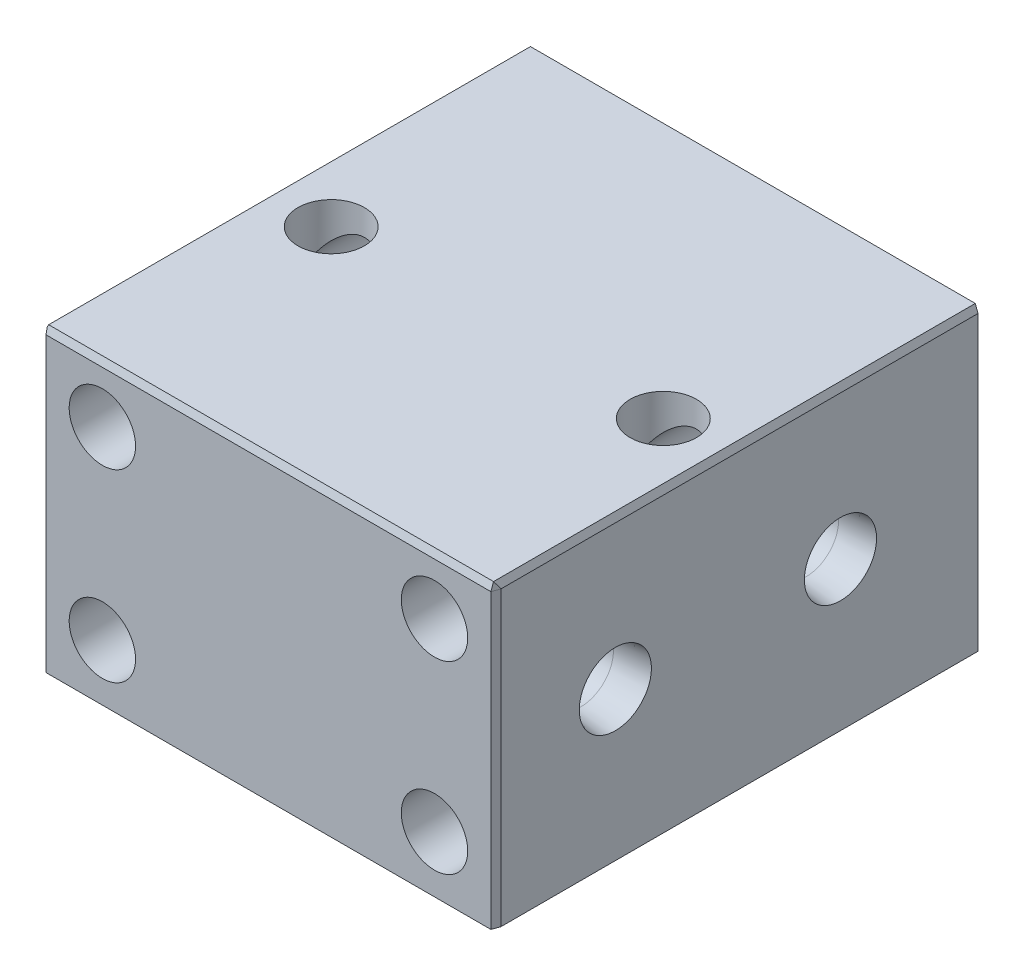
ISO-10303-21;
HEADER;
FILE_DESCRIPTION(('STEP AP214'),'2;1');
FILE_NAME('part.step','',(''),(''),'','','');
FILE_SCHEMA(('AUTOMOTIVE_DESIGN { 1 0 10303 214 1 1 1 1 }'));
ENDSEC;
DATA;
#1=APPLICATION_CONTEXT('core data for automotive mechanical design processes');
#2=APPLICATION_PROTOCOL_DEFINITION('international standard','automotive_design',2000,#1);
#3=PRODUCT_CONTEXT('',#1,'mechanical');
#4=PRODUCT('Part','Part','',(#3));
#5=PRODUCT_RELATED_PRODUCT_CATEGORY('part','',(#4));
#6=PRODUCT_DEFINITION_FORMATION('','',#4);
#7=PRODUCT_DEFINITION_CONTEXT('part definition',#1,'design');
#8=PRODUCT_DEFINITION('design','',#6,#7);
#9=PRODUCT_DEFINITION_SHAPE('','',#8);
#10=(LENGTH_UNIT() NAMED_UNIT(*) SI_UNIT(.MILLI.,.METRE.));
#11=(NAMED_UNIT(*) PLANE_ANGLE_UNIT() SI_UNIT($,.RADIAN.));
#12=(NAMED_UNIT(*) SI_UNIT($,.STERADIAN.) SOLID_ANGLE_UNIT());
#13=UNCERTAINTY_MEASURE_WITH_UNIT(LENGTH_MEASURE(1.E-05),#10,'distance_accuracy_value','');
#14=(GEOMETRIC_REPRESENTATION_CONTEXT(3) GLOBAL_UNCERTAINTY_ASSIGNED_CONTEXT((#13)) GLOBAL_UNIT_ASSIGNED_CONTEXT((#10,
#11,#12)) REPRESENTATION_CONTEXT('',''));
#15=CARTESIAN_POINT('',(0.,0.,0.));
#16=DIRECTION('',(0.,0.,1.));
#17=DIRECTION('',(1.,0.,0.));
#18=AXIS2_PLACEMENT_3D('',#15,#16,#17);
#19=CARTESIAN_POINT('',(22.5,12.5,66.));
#20=DIRECTION('',(0.,0.,-1.));
#21=DIRECTION('',(-1.,0.,0.));
#22=AXIS2_PLACEMENT_3D('',#19,#20,#21);
#23=CYLINDRICAL_SURFACE('',#22,4.5);
#24=CARTESIAN_POINT('',(22.5,12.5,0.));
#25=DIRECTION('',(0.,0.,-1.));
#26=DIRECTION('',(-1.,0.,0.));
#27=AXIS2_PLACEMENT_3D('',#24,#25,#26);
#28=CIRCLE('',#27,4.5);
#29=CARTESIAN_POINT('',(18.,12.5,0.));
#30=VERTEX_POINT('',#29);
#31=EDGE_CURVE('E232',#30,#30,#28,.T.);
#32=ORIENTED_EDGE('',*,*,#31,.T.);
#33=EDGE_LOOP('',(#32));
#34=FACE_BOUND('',#33,.T.);
#35=CARTESIAN_POINT('',(22.5,12.5,35.));
#36=DIRECTION('',(0.,-0.707106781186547,-0.707106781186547));
#37=DIRECTION('',(0.,0.707106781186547,-0.707106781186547));
#38=AXIS2_PLACEMENT_3D('',#35,#36,#37);
#39=ELLIPSE('',#38,6.36396103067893,4.5);
#40=CARTESIAN_POINT('',(27.,12.5,35.));
#41=VERTEX_POINT('',#40);
#42=CARTESIAN_POINT('',(18.,12.5,35.));
#43=VERTEX_POINT('',#42);
#44=EDGE_CURVE('E192',#41,#43,#39,.F.);
#45=ORIENTED_EDGE('',*,*,#44,.T.);
#46=CARTESIAN_POINT('',(22.5,12.5,35.));
#47=DIRECTION('',(0.,0.707106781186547,-0.707106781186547));
#48=DIRECTION('',(0.,-0.707106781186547,-0.707106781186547));
#49=AXIS2_PLACEMENT_3D('',#46,#47,#48);
#50=ELLIPSE('',#49,6.36396103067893,4.5);
#51=EDGE_CURVE('E208',#43,#41,#50,.F.);
#52=ORIENTED_EDGE('',*,*,#51,.T.);
#53=EDGE_LOOP('',(#45,#52));
#54=FACE_BOUND('',#53,.T.);
#55=ADVANCED_FACE('F33',(#34,#54),#23,.F.);
#56=CARTESIAN_POINT('',(-22.5,-12.5,66.));
#57=DIRECTION('',(0.,0.,-1.));
#58=DIRECTION('',(-1.,0.,0.));
#59=AXIS2_PLACEMENT_3D('',#56,#57,#58);
#60=CYLINDRICAL_SURFACE('',#59,4.5);
#61=CARTESIAN_POINT('',(-22.5,-12.5,0.));
#62=DIRECTION('',(0.,0.,-1.));
#63=DIRECTION('',(-1.,0.,0.));
#64=AXIS2_PLACEMENT_3D('',#61,#62,#63);
#65=CIRCLE('',#64,4.5);
#66=CARTESIAN_POINT('',(-27.,-12.5,0.));
#67=VERTEX_POINT('',#66);
#68=EDGE_CURVE('E222',#67,#67,#65,.T.);
#69=ORIENTED_EDGE('',*,*,#68,.T.);
#70=EDGE_LOOP('',(#69));
#71=FACE_BOUND('',#70,.T.);
#72=CARTESIAN_POINT('',(-22.5,-12.5,35.));
#73=DIRECTION('',(0.,-0.707106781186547,-0.707106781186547));
#74=DIRECTION('',(0.,0.707106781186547,-0.707106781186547));
#75=AXIS2_PLACEMENT_3D('',#72,#73,#74);
#76=ELLIPSE('',#75,6.36396103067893,4.5);
#77=CARTESIAN_POINT('',(-18.,-12.5,35.));
#78=VERTEX_POINT('',#77);
#79=CARTESIAN_POINT('',(-27.,-12.5,35.));
#80=VERTEX_POINT('',#79);
#81=EDGE_CURVE('E211',#78,#80,#76,.F.);
#82=ORIENTED_EDGE('',*,*,#81,.T.);
#83=CARTESIAN_POINT('',(-22.5,-12.5,35.));
#84=DIRECTION('',(0.,0.707106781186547,-0.707106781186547));
#85=DIRECTION('',(0.,-0.707106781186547,-0.707106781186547));
#86=AXIS2_PLACEMENT_3D('',#83,#84,#85);
#87=ELLIPSE('',#86,6.36396103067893,4.5);
#88=EDGE_CURVE('E219',#80,#78,#87,.F.);
#89=ORIENTED_EDGE('',*,*,#88,.T.);
#90=EDGE_LOOP('',(#82,#89));
#91=FACE_BOUND('',#90,.T.);
#92=ADVANCED_FACE('F479',(#71,#91),#60,.F.);
#93=CARTESIAN_POINT('',(-22.5,12.5,66.));
#94=DIRECTION('',(0.,0.,-1.));
#95=DIRECTION('',(-1.,0.,0.));
#96=AXIS2_PLACEMENT_3D('',#93,#94,#95);
#97=CYLINDRICAL_SURFACE('',#96,4.5);
#98=CARTESIAN_POINT('',(-22.5,12.5,0.));
#99=DIRECTION('',(0.,0.,-1.));
#100=DIRECTION('',(-1.,0.,0.));
#101=AXIS2_PLACEMENT_3D('',#98,#99,#100);
#102=CIRCLE('',#101,4.5);
#103=CARTESIAN_POINT('',(-27.,12.5,0.));
#104=VERTEX_POINT('',#103);
#105=EDGE_CURVE('E226',#104,#104,#102,.T.);
#106=ORIENTED_EDGE('',*,*,#105,.T.);
#107=EDGE_LOOP('',(#106));
#108=FACE_BOUND('',#107,.T.);
#109=CARTESIAN_POINT('',(-22.5,12.5,35.));
#110=DIRECTION('',(0.,-0.707106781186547,-0.707106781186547));
#111=DIRECTION('',(0.,0.707106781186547,-0.707106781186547));
#112=AXIS2_PLACEMENT_3D('',#109,#110,#111);
#113=ELLIPSE('',#112,6.36396103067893,4.5);
#114=CARTESIAN_POINT('',(-18.,12.5,35.));
#115=VERTEX_POINT('',#114);
#116=CARTESIAN_POINT('',(-27.,12.5,35.));
#117=VERTEX_POINT('',#116);
#118=EDGE_CURVE('E263',#115,#117,#113,.F.);
#119=ORIENTED_EDGE('',*,*,#118,.T.);
#120=CARTESIAN_POINT('',(-22.5,12.5,35.));
#121=DIRECTION('',(0.,0.707106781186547,-0.707106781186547));
#122=DIRECTION('',(0.,-0.707106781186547,-0.707106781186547));
#123=AXIS2_PLACEMENT_3D('',#120,#121,#122);
#124=ELLIPSE('',#123,6.36396103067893,4.5);
#125=EDGE_CURVE('E271',#117,#115,#124,.F.);
#126=ORIENTED_EDGE('',*,*,#125,.T.);
#127=EDGE_LOOP('',(#119,#126));
#128=FACE_BOUND('',#127,.T.);
#129=ADVANCED_FACE('F486',(#108,#128),#97,.F.);
#130=CARTESIAN_POINT('',(22.5,-12.5,66.));
#131=DIRECTION('',(0.,0.,-1.));
#132=DIRECTION('',(-1.,0.,0.));
#133=AXIS2_PLACEMENT_3D('',#130,#131,#132);
#134=CYLINDRICAL_SURFACE('',#133,4.5);
#135=CARTESIAN_POINT('',(22.5,-12.5,0.));
#136=DIRECTION('',(0.,0.,-1.));
#137=DIRECTION('',(-1.,0.,0.));
#138=AXIS2_PLACEMENT_3D('',#135,#136,#137);
#139=CIRCLE('',#138,4.5);
#140=CARTESIAN_POINT('',(18.,-12.5,0.));
#141=VERTEX_POINT('',#140);
#142=EDGE_CURVE('E233',#141,#141,#139,.T.);
#143=ORIENTED_EDGE('',*,*,#142,.T.);
#144=EDGE_LOOP('',(#143));
#145=FACE_BOUND('',#144,.T.);
#146=CARTESIAN_POINT('',(22.5,-12.5,35.));
#147=DIRECTION('',(0.,-0.707106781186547,-0.707106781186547));
#148=DIRECTION('',(0.,0.707106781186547,-0.707106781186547));
#149=AXIS2_PLACEMENT_3D('',#146,#147,#148);
#150=ELLIPSE('',#149,6.36396103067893,4.5);
#151=CARTESIAN_POINT('',(27.,-12.5,35.));
#152=VERTEX_POINT('',#151);
#153=CARTESIAN_POINT('',(18.,-12.5,35.));
#154=VERTEX_POINT('',#153);
#155=EDGE_CURVE('E250',#152,#154,#150,.F.);
#156=ORIENTED_EDGE('',*,*,#155,.T.);
#157=CARTESIAN_POINT('',(22.5,-12.5,35.));
#158=DIRECTION('',(0.,0.707106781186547,-0.707106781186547));
#159=DIRECTION('',(0.,-0.707106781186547,-0.707106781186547));
#160=AXIS2_PLACEMENT_3D('',#157,#158,#159);
#161=ELLIPSE('',#160,6.36396103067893,4.5);
#162=EDGE_CURVE('E260',#154,#152,#161,.F.);
#163=ORIENTED_EDGE('',*,*,#162,.T.);
#164=EDGE_LOOP('',(#156,#163));
#165=FACE_BOUND('',#164,.T.);
#166=ADVANCED_FACE('F526',(#145,#165),#134,.F.);
#167=CARTESIAN_POINT('',(30.5,20.5,66.));
#168=DIRECTION('',(-1.,0.,0.));
#169=DIRECTION('',(0.,0.,1.));
#170=AXIS2_PLACEMENT_3D('',#167,#168,#169);
#171=PLANE('',#170);
#172=DIRECTION('',(0.,0.,1.));
#173=VECTOR('',#172,1.);
#174=CARTESIAN_POINT('',(30.5,19.5,66.));
#175=LINE('',#174,#173);
#176=CARTESIAN_POINT('',(30.5,19.5,0.363970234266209));
#177=VERTEX_POINT('',#176);
#178=CARTESIAN_POINT('',(30.5,19.5,65.));
#179=VERTEX_POINT('',#178);
#180=EDGE_CURVE('E302',#177,#179,#175,.T.);
#181=ORIENTED_EDGE('',*,*,#180,.T.);
#182=DIRECTION('',(0.,-1.,0.));
#183=VECTOR('',#182,1.);
#184=CARTESIAN_POINT('',(30.5,-20.5,65.));
#185=LINE('',#184,#183);
#186=CARTESIAN_POINT('',(30.5,-20.1360297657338,65.));
#187=VERTEX_POINT('',#186);
#188=EDGE_CURVE('E308',#179,#187,#185,.T.);
#189=ORIENTED_EDGE('',*,*,#188,.T.);
#190=DIRECTION('',(0.,0.,-1.));
#191=VECTOR('',#190,1.);
#192=CARTESIAN_POINT('',(30.5,-20.1360297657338,66.));
#193=LINE('',#192,#191);
#194=CARTESIAN_POINT('',(30.5,-20.1360297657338,0.363970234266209));
#195=VERTEX_POINT('',#194);
#196=EDGE_CURVE('E306',#187,#195,#193,.T.);
#197=ORIENTED_EDGE('',*,*,#196,.T.);
#198=DIRECTION('',(0.,1.,0.));
#199=VECTOR('',#198,1.);
#200=CARTESIAN_POINT('',(30.5,20.5,0.363970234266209));
#201=LINE('',#200,#199);
#202=EDGE_CURVE('E304',#195,#177,#201,.T.);
#203=ORIENTED_EDGE('',*,*,#202,.T.);
#204=EDGE_LOOP('',(#181,#189,#197,#203));
#205=FACE_BOUND('',#204,.T.);
#206=CARTESIAN_POINT('',(30.5,0.,19.));
#207=DIRECTION('',(1.,0.,0.));
#208=DIRECTION('',(0.,0.,-1.));
#209=AXIS2_PLACEMENT_3D('',#206,#207,#208);
#210=CIRCLE('',#209,4.889);
#211=CARTESIAN_POINT('',(30.5,0.,14.111));
#212=VERTEX_POINT('',#211);
#213=EDGE_CURVE('E179',#212,#212,#210,.T.);
#214=ORIENTED_EDGE('',*,*,#213,.F.);
#215=EDGE_LOOP('',(#214));
#216=FACE_BOUND('',#215,.T.);
#217=CARTESIAN_POINT('',(30.5,0.,49.5));
#218=DIRECTION('',(1.,0.,0.));
#219=DIRECTION('',(0.,0.,-1.));
#220=AXIS2_PLACEMENT_3D('',#217,#218,#219);
#221=CIRCLE('',#220,4.889);
#222=CARTESIAN_POINT('',(30.5,0.,44.611));
#223=VERTEX_POINT('',#222);
#224=EDGE_CURVE('E172',#223,#223,#221,.T.);
#225=ORIENTED_EDGE('',*,*,#224,.F.);
#226=EDGE_LOOP('',(#225));
#227=FACE_BOUND('',#226,.T.);
#228=ADVANCED_FACE('F426',(#205,#216,#227),#171,.F.);
#229=CARTESIAN_POINT('',(-30.5,20.5,66.));
#230=DIRECTION('',(0.,-1.,0.));
#231=DIRECTION('',(0.,0.,-1.));
#232=AXIS2_PLACEMENT_3D('',#229,#230,#231);
#233=PLANE('',#232);
#234=DIRECTION('',(-1.,0.,0.));
#235=VECTOR('',#234,1.);
#236=CARTESIAN_POINT('',(-30.5,20.5,0.363970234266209));
#237=LINE('',#236,#235);
#238=CARTESIAN_POINT('',(30.1360297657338,20.5,0.363970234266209));
#239=VERTEX_POINT('',#238);
#240=CARTESIAN_POINT('',(-30.1360297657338,20.5,0.363970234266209));
#241=VERTEX_POINT('',#240);
#242=EDGE_CURVE('E311',#239,#241,#237,.T.);
#243=ORIENTED_EDGE('',*,*,#242,.T.);
#244=DIRECTION('',(0.,0.,1.));
#245=VECTOR('',#244,1.);
#246=CARTESIAN_POINT('',(-30.1360297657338,20.5,66.));
#247=LINE('',#246,#245);
#248=CARTESIAN_POINT('',(-30.1360297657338,20.5,65.6360297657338));
#249=VERTEX_POINT('',#248);
#250=EDGE_CURVE('E318',#241,#249,#247,.T.);
#251=ORIENTED_EDGE('',*,*,#250,.T.);
#252=DIRECTION('',(1.,0.,0.));
#253=VECTOR('',#252,1.);
#254=CARTESIAN_POINT('',(30.5,20.5,65.6360297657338));
#255=LINE('',#254,#253);
#256=CARTESIAN_POINT('',(30.1360297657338,20.5,65.6360297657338));
#257=VERTEX_POINT('',#256);
#258=EDGE_CURVE('E316',#249,#257,#255,.T.);
#259=ORIENTED_EDGE('',*,*,#258,.T.);
#260=DIRECTION('',(0.,0.,-1.));
#261=VECTOR('',#260,1.);
#262=CARTESIAN_POINT('',(30.1360297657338,20.5,66.));
#263=LINE('',#262,#261);
#264=EDGE_CURVE('E314',#257,#239,#263,.T.);
#265=ORIENTED_EDGE('',*,*,#264,.T.);
#266=EDGE_LOOP('',(#243,#251,#259,#265));
#267=FACE_BOUND('',#266,.T.);
#268=CARTESIAN_POINT('',(-22.5,20.5,35.));
#269=DIRECTION('',(0.,1.,0.));
#270=DIRECTION('',(0.,0.,1.));
#271=AXIS2_PLACEMENT_3D('',#268,#269,#270);
#272=CIRCLE('',#271,4.5);
#273=CARTESIAN_POINT('',(-22.5,20.5,39.5));
#274=VERTEX_POINT('',#273);
#275=EDGE_CURVE('E193',#274,#274,#272,.T.);
#276=ORIENTED_EDGE('',*,*,#275,.F.);
#277=EDGE_LOOP('',(#276));
#278=FACE_BOUND('',#277,.T.);
#279=CARTESIAN_POINT('',(22.5,20.5,35.));
#280=DIRECTION('',(0.,1.,0.));
#281=DIRECTION('',(0.,0.,1.));
#282=AXIS2_PLACEMENT_3D('',#279,#280,#281);
#283=CIRCLE('',#282,4.5);
#284=CARTESIAN_POINT('',(22.5,20.5,39.5));
#285=VERTEX_POINT('',#284);
#286=EDGE_CURVE('E188',#285,#285,#283,.T.);
#287=ORIENTED_EDGE('',*,*,#286,.F.);
#288=EDGE_LOOP('',(#287));
#289=FACE_BOUND('',#288,.T.);
#290=ADVANCED_FACE('F440',(#267,#278,#289),#233,.F.);
#291=CARTESIAN_POINT('',(-30.5,20.5,66.));
#292=DIRECTION('',(1.,0.,0.));
#293=DIRECTION('',(0.,1.,0.));
#294=AXIS2_PLACEMENT_3D('',#291,#292,#293);
#295=PLANE('',#294);
#296=DIRECTION('',(0.,0.,1.));
#297=VECTOR('',#296,1.);
#298=CARTESIAN_POINT('',(-30.5,-19.5,66.));
#299=LINE('',#298,#297);
#300=CARTESIAN_POINT('',(-30.5,-19.5,0.363970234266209));
#301=VERTEX_POINT('',#300);
#302=CARTESIAN_POINT('',(-30.5,-19.5,65.));
#303=VERTEX_POINT('',#302);
#304=EDGE_CURVE('E292',#301,#303,#299,.T.);
#305=ORIENTED_EDGE('',*,*,#304,.T.);
#306=DIRECTION('',(0.,1.,0.));
#307=VECTOR('',#306,1.);
#308=CARTESIAN_POINT('',(-30.5,19.5,65.));
#309=LINE('',#308,#307);
#310=CARTESIAN_POINT('',(-30.5,19.5,65.));
#311=VERTEX_POINT('',#310);
#312=EDGE_CURVE('E378',#303,#311,#309,.T.);
#313=ORIENTED_EDGE('',*,*,#312,.T.);
#314=DIRECTION('',(0.,0.,-1.));
#315=VECTOR('',#314,1.);
#316=CARTESIAN_POINT('',(-30.5,19.5,66.));
#317=LINE('',#316,#315);
#318=CARTESIAN_POINT('',(-30.5,19.5,0.363970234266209));
#319=VERTEX_POINT('',#318);
#320=EDGE_CURVE('E289',#311,#319,#317,.T.);
#321=ORIENTED_EDGE('',*,*,#320,.T.);
#322=DIRECTION('',(0.,-1.,0.));
#323=VECTOR('',#322,1.);
#324=CARTESIAN_POINT('',(-30.5,20.5,0.363970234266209));
#325=LINE('',#324,#323);
#326=EDGE_CURVE('E375',#319,#301,#325,.T.);
#327=ORIENTED_EDGE('',*,*,#326,.T.);
#328=EDGE_LOOP('',(#305,#313,#321,#327));
#329=FACE_BOUND('',#328,.T.);
#330=ADVANCED_FACE('F449',(#329),#295,.F.);
#331=CARTESIAN_POINT('',(-30.5,-20.5,66.));
#332=DIRECTION('',(0.,1.,0.));
#333=DIRECTION('',(0.,0.,1.));
#334=AXIS2_PLACEMENT_3D('',#331,#332,#333);
#335=PLANE('',#334);
#336=DIRECTION('',(0.,0.,-1.));
#337=VECTOR('',#336,1.);
#338=CARTESIAN_POINT('',(-30.1360297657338,-20.5,66.));
#339=LINE('',#338,#337);
#340=CARTESIAN_POINT('',(-30.1360297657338,-20.5,65.));
#341=VERTEX_POINT('',#340);
#342=CARTESIAN_POINT('',(-30.1360297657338,-20.5,0.363970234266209));
#343=VERTEX_POINT('',#342);
#344=EDGE_CURVE('E278',#341,#343,#339,.T.);
#345=ORIENTED_EDGE('',*,*,#344,.T.);
#346=DIRECTION('',(1.,0.,0.));
#347=VECTOR('',#346,1.);
#348=CARTESIAN_POINT('',(-30.5,-20.5,0.363970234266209));
#349=LINE('',#348,#347);
#350=CARTESIAN_POINT('',(29.5,-20.5,0.363970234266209));
#351=VERTEX_POINT('',#350);
#352=EDGE_CURVE('E280',#343,#351,#349,.T.);
#353=ORIENTED_EDGE('',*,*,#352,.T.);
#354=DIRECTION('',(0.,0.,1.));
#355=VECTOR('',#354,1.);
#356=CARTESIAN_POINT('',(29.5,-20.5,66.));
#357=LINE('',#356,#355);
#358=CARTESIAN_POINT('',(29.5,-20.5,65.));
#359=VERTEX_POINT('',#358);
#360=EDGE_CURVE('E274',#351,#359,#357,.T.);
#361=ORIENTED_EDGE('',*,*,#360,.T.);
#362=DIRECTION('',(-1.,0.,0.));
#363=VECTOR('',#362,1.);
#364=CARTESIAN_POINT('',(-30.5,-20.5,65.));
#365=LINE('',#364,#363);
#366=EDGE_CURVE('E276',#359,#341,#365,.T.);
#367=ORIENTED_EDGE('',*,*,#366,.T.);
#368=EDGE_LOOP('',(#345,#353,#361,#367));
#369=FACE_BOUND('',#368,.T.);
#370=CARTESIAN_POINT('',(0.,-20.5,49.5));
#371=DIRECTION('',(0.,-1.,0.));
#372=DIRECTION('',(0.,0.,-1.));
#373=AXIS2_PLACEMENT_3D('',#370,#371,#372);
#374=CIRCLE('',#373,5.);
#375=CARTESIAN_POINT('',(0.,-20.5,44.5));
#376=VERTEX_POINT('',#375);
#377=EDGE_CURVE('E956',#376,#376,#374,.T.);
#378=ORIENTED_EDGE('',*,*,#377,.F.);
#379=EDGE_LOOP('',(#378));
#380=FACE_BOUND('',#379,.T.);
#381=CARTESIAN_POINT('',(0.,-20.5,19.));
#382=DIRECTION('',(0.,-1.,0.));
#383=DIRECTION('',(0.,0.,-1.));
#384=AXIS2_PLACEMENT_3D('',#381,#382,#383);
#385=CIRCLE('',#384,5.);
#386=CARTESIAN_POINT('',(0.,-20.5,14.));
#387=VERTEX_POINT('',#386);
#388=EDGE_CURVE('E366',#387,#387,#385,.T.);
#389=ORIENTED_EDGE('',*,*,#388,.F.);
#390=EDGE_LOOP('',(#389));
#391=FACE_BOUND('',#390,.T.);
#392=CARTESIAN_POINT('',(-22.5,-20.5,35.));
#393=DIRECTION('',(0.,1.,0.));
#394=DIRECTION('',(0.,0.,1.));
#395=AXIS2_PLACEMENT_3D('',#392,#393,#394);
#396=CIRCLE('',#395,4.5);
#397=CARTESIAN_POINT('',(-22.5,-20.5,39.5));
#398=VERTEX_POINT('',#397);
#399=EDGE_CURVE('E189',#398,#398,#396,.T.);
#400=ORIENTED_EDGE('',*,*,#399,.T.);
#401=EDGE_LOOP('',(#400));
#402=FACE_BOUND('',#401,.T.);
#403=CARTESIAN_POINT('',(22.5,-20.5,35.));
#404=DIRECTION('',(0.,1.,0.));
#405=DIRECTION('',(0.,0.,1.));
#406=AXIS2_PLACEMENT_3D('',#403,#404,#405);
#407=CIRCLE('',#406,4.5);
#408=CARTESIAN_POINT('',(22.5,-20.5,39.5));
#409=VERTEX_POINT('',#408);
#410=EDGE_CURVE('E196',#409,#409,#407,.T.);
#411=ORIENTED_EDGE('',*,*,#410,.T.);
#412=EDGE_LOOP('',(#411));
#413=FACE_BOUND('',#412,.T.);
#414=ADVANCED_FACE('F414',(#369,#380,#391,#402,#413),#335,.F.);
#415=CARTESIAN_POINT('',(0.,0.,66.));
#416=DIRECTION('',(0.,0.,1.));
#417=DIRECTION('',(1.,0.,0.));
#418=AXIS2_PLACEMENT_3D('',#415,#416,#417);
#419=PLANE('',#418);
#420=CARTESIAN_POINT('',(22.5,-12.5,66.));
#421=DIRECTION('',(0.,0.,-1.));
#422=DIRECTION('',(-1.,0.,0.));
#423=AXIS2_PLACEMENT_3D('',#420,#421,#422);
#424=CIRCLE('',#423,4.5);
#425=CARTESIAN_POINT('',(18.,-12.5,66.));
#426=VERTEX_POINT('',#425);
#427=EDGE_CURVE('E229',#426,#426,#424,.T.);
#428=ORIENTED_EDGE('',*,*,#427,.T.);
#429=EDGE_LOOP('',(#428));
#430=FACE_BOUND('',#429,.T.);
#431=CARTESIAN_POINT('',(-22.5,12.5,66.));
#432=DIRECTION('',(0.,0.,-1.));
#433=DIRECTION('',(-1.,0.,0.));
#434=AXIS2_PLACEMENT_3D('',#431,#432,#433);
#435=CIRCLE('',#434,4.5);
#436=CARTESIAN_POINT('',(-27.,12.5,66.));
#437=VERTEX_POINT('',#436);
#438=EDGE_CURVE('E236',#437,#437,#435,.T.);
#439=ORIENTED_EDGE('',*,*,#438,.T.);
#440=EDGE_LOOP('',(#439));
#441=FACE_BOUND('',#440,.T.);
#442=CARTESIAN_POINT('',(-22.5,-12.5,66.));
#443=DIRECTION('',(0.,0.,-1.));
#444=DIRECTION('',(-1.,0.,0.));
#445=AXIS2_PLACEMENT_3D('',#442,#443,#444);
#446=CIRCLE('',#445,4.5);
#447=CARTESIAN_POINT('',(-27.,-12.5,66.));
#448=VERTEX_POINT('',#447);
#449=EDGE_CURVE('E223',#448,#448,#446,.T.);
#450=ORIENTED_EDGE('',*,*,#449,.T.);
#451=EDGE_LOOP('',(#450));
#452=FACE_BOUND('',#451,.T.);
#453=CARTESIAN_POINT('',(22.5,12.5,66.));
#454=DIRECTION('',(0.,0.,-1.));
#455=DIRECTION('',(-1.,0.,0.));
#456=AXIS2_PLACEMENT_3D('',#453,#454,#455);
#457=CIRCLE('',#456,4.5);
#458=CARTESIAN_POINT('',(18.,12.5,66.));
#459=VERTEX_POINT('',#458);
#460=EDGE_CURVE('E241',#459,#459,#457,.T.);
#461=ORIENTED_EDGE('',*,*,#460,.T.);
#462=EDGE_LOOP('',(#461));
#463=FACE_BOUND('',#462,.T.);
#464=DIRECTION('',(-1.,0.,0.));
#465=VECTOR('',#464,1.);
#466=CARTESIAN_POINT('',(-30.5,19.5,66.));
#467=LINE('',#466,#465);
#468=CARTESIAN_POINT('',(30.1360297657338,19.5,66.));
#469=VERTEX_POINT('',#468);
#470=CARTESIAN_POINT('',(-30.1360297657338,19.5,66.));
#471=VERTEX_POINT('',#470);
#472=EDGE_CURVE('E295',#469,#471,#467,.T.);
#473=ORIENTED_EDGE('',*,*,#472,.T.);
#474=DIRECTION('',(0.,-1.,0.));
#475=VECTOR('',#474,1.);
#476=CARTESIAN_POINT('',(-30.1360297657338,-19.5,66.));
#477=LINE('',#476,#475);
#478=CARTESIAN_POINT('',(-30.1360297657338,-20.1360297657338,66.));
#479=VERTEX_POINT('',#478);
#480=EDGE_CURVE('E321',#471,#479,#477,.T.);
#481=ORIENTED_EDGE('',*,*,#480,.T.);
#482=DIRECTION('',(1.,0.,0.));
#483=VECTOR('',#482,1.);
#484=CARTESIAN_POINT('',(30.5,-20.1360297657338,66.));
#485=LINE('',#484,#483);
#486=CARTESIAN_POINT('',(30.1360297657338,-20.1360297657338,66.));
#487=VERTEX_POINT('',#486);
#488=EDGE_CURVE('E300',#479,#487,#485,.T.);
#489=ORIENTED_EDGE('',*,*,#488,.T.);
#490=DIRECTION('',(0.,1.,0.));
#491=VECTOR('',#490,1.);
#492=CARTESIAN_POINT('',(30.1360297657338,20.5,66.));
#493=LINE('',#492,#491);
#494=EDGE_CURVE('E298',#487,#469,#493,.T.);
#495=ORIENTED_EDGE('',*,*,#494,.T.);
#496=EDGE_LOOP('',(#473,#481,#489,#495));
#497=FACE_BOUND('',#496,.T.);
#498=ADVANCED_FACE('F397',(#430,#441,#452,#463,#497),#419,.T.);
#499=CARTESIAN_POINT('',(0.,0.,0.));
#500=DIRECTION('',(0.,0.,1.));
#501=DIRECTION('',(1.,0.,0.));
#502=AXIS2_PLACEMENT_3D('',#499,#500,#501);
#503=PLANE('',#502);
#504=ORIENTED_EDGE('',*,*,#142,.F.);
#505=EDGE_LOOP('',(#504));
#506=FACE_BOUND('',#505,.T.);
#507=ORIENTED_EDGE('',*,*,#105,.F.);
#508=EDGE_LOOP('',(#507));
#509=FACE_BOUND('',#508,.T.);
#510=ORIENTED_EDGE('',*,*,#68,.F.);
#511=EDGE_LOOP('',(#510));
#512=FACE_BOUND('',#511,.T.);
#513=ORIENTED_EDGE('',*,*,#31,.F.);
#514=EDGE_LOOP('',(#513));
#515=FACE_BOUND('',#514,.T.);
#516=CARTESIAN_POINT('',(0.,0.,0.));
#517=DIRECTION('',(0.,0.,-1.));
#518=DIRECTION('',(-1.,0.,0.));
#519=AXIS2_PLACEMENT_3D('',#516,#517,#518);
#520=CIRCLE('',#519,6.);
#521=CARTESIAN_POINT('',(-6.,0.,0.));
#522=VERTEX_POINT('',#521);
#523=EDGE_CURVE('E244',#522,#522,#520,.T.);
#524=ORIENTED_EDGE('',*,*,#523,.F.);
#525=EDGE_LOOP('',(#524));
#526=FACE_BOUND('',#525,.T.);
#527=DIRECTION('',(-1.,0.,0.));
#528=VECTOR('',#527,1.);
#529=CARTESIAN_POINT('',(0.,-19.5,0.));
#530=LINE('',#529,#528);
#531=CARTESIAN_POINT('',(29.5,-19.5,0.));
#532=VERTEX_POINT('',#531);
#533=CARTESIAN_POINT('',(-29.5,-19.5,0.));
#534=VERTEX_POINT('',#533);
#535=EDGE_CURVE('E287',#532,#534,#530,.T.);
#536=ORIENTED_EDGE('',*,*,#535,.T.);
#537=DIRECTION('',(0.,1.,0.));
#538=VECTOR('',#537,1.);
#539=CARTESIAN_POINT('',(-29.5,0.,0.));
#540=LINE('',#539,#538);
#541=CARTESIAN_POINT('',(-29.5,19.5,0.));
#542=VERTEX_POINT('',#541);
#543=EDGE_CURVE('E41',#534,#542,#540,.T.);
#544=ORIENTED_EDGE('',*,*,#543,.T.);
#545=DIRECTION('',(1.,0.,0.));
#546=VECTOR('',#545,1.);
#547=CARTESIAN_POINT('',(0.,19.5,0.));
#548=LINE('',#547,#546);
#549=CARTESIAN_POINT('',(29.5,19.5,0.));
#550=VERTEX_POINT('',#549);
#551=EDGE_CURVE('E283',#542,#550,#548,.T.);
#552=ORIENTED_EDGE('',*,*,#551,.T.);
#553=DIRECTION('',(0.,-1.,0.));
#554=VECTOR('',#553,1.);
#555=CARTESIAN_POINT('',(29.5,0.,0.));
#556=LINE('',#555,#554);
#557=EDGE_CURVE('E285',#550,#532,#556,.T.);
#558=ORIENTED_EDGE('',*,*,#557,.T.);
#559=EDGE_LOOP('',(#536,#544,#552,#558));
#560=FACE_BOUND('',#559,.T.);
#561=ADVANCED_FACE('F458',(#506,#509,#512,#515,#526,#560),#503,.F.);
#562=CARTESIAN_POINT('',(0.,0.,50.));
#563=DIRECTION('',(0.,0.,-1.));
#564=DIRECTION('',(-1.,0.,0.));
#565=AXIS2_PLACEMENT_3D('',#562,#563,#564);
#566=CYLINDRICAL_SURFACE('',#565,6.);
#567=CARTESIAN_POINT('',(0.,0.,50.));
#568=DIRECTION('',(0.,0.,-1.));
#569=DIRECTION('',(-1.,0.,0.));
#570=AXIS2_PLACEMENT_3D('',#567,#568,#569);
#571=CIRCLE('',#570,6.);
#572=CARTESIAN_POINT('',(-6.,0.,50.));
#573=VERTEX_POINT('',#572);
#574=EDGE_CURVE('E247',#573,#573,#571,.T.);
#575=ORIENTED_EDGE('',*,*,#574,.F.);
#576=EDGE_LOOP('',(#575));
#577=FACE_BOUND('',#576,.T.);
#578=ORIENTED_EDGE('',*,*,#523,.T.);
#579=EDGE_LOOP('',(#578));
#580=FACE_BOUND('',#579,.T.);
#581=ADVANCED_FACE('F502',(#577,#580),#566,.F.);
#582=CARTESIAN_POINT('',(0.,0.,50.));
#583=DIRECTION('',(0.,0.,-1.));
#584=DIRECTION('',(-1.,0.,0.));
#585=AXIS2_PLACEMENT_3D('',#582,#583,#584);
#586=PLANE('',#585);
#587=ORIENTED_EDGE('',*,*,#574,.T.);
#588=EDGE_LOOP('',(#587));
#589=FACE_BOUND('',#588,.T.);
#590=ADVANCED_FACE('F494',(#589),#586,.T.);
#591=CARTESIAN_POINT('',(22.5,12.5,35.));
#592=DIRECTION('',(0.,-0.707106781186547,-0.707106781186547));
#593=DIRECTION('',(0.,0.707106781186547,-0.707106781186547));
#594=AXIS2_PLACEMENT_3D('',#591,#592,#593);
#595=ELLIPSE('',#594,6.36396103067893,4.5);
#596=EDGE_CURVE('E202',#41,#43,#595,.T.);
#597=ORIENTED_EDGE('',*,*,#596,.T.);
#598=CARTESIAN_POINT('',(22.5,12.5,35.));
#599=DIRECTION('',(0.,0.707106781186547,-0.707106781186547));
#600=DIRECTION('',(0.,-0.707106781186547,-0.707106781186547));
#601=AXIS2_PLACEMENT_3D('',#598,#599,#600);
#602=ELLIPSE('',#601,6.36396103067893,4.5);
#603=EDGE_CURVE('E205',#43,#41,#602,.T.);
#604=ORIENTED_EDGE('',*,*,#603,.T.);
#605=EDGE_LOOP('',(#597,#604));
#606=FACE_BOUND('',#605,.T.);
#607=ORIENTED_EDGE('',*,*,#460,.F.);
#608=EDGE_LOOP('',(#607));
#609=FACE_BOUND('',#608,.T.);
#610=ADVANCED_FACE('F482',(#606,#609),#23,.F.);
#611=CARTESIAN_POINT('',(-22.5,-12.5,35.));
#612=DIRECTION('',(0.,-0.707106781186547,-0.707106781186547));
#613=DIRECTION('',(0.,0.707106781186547,-0.707106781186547));
#614=AXIS2_PLACEMENT_3D('',#611,#612,#613);
#615=ELLIPSE('',#614,6.36396103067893,4.5);
#616=EDGE_CURVE('E213',#78,#80,#615,.T.);
#617=ORIENTED_EDGE('',*,*,#616,.T.);
#618=CARTESIAN_POINT('',(-22.5,-12.5,35.));
#619=DIRECTION('',(0.,0.707106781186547,-0.707106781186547));
#620=DIRECTION('',(0.,-0.707106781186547,-0.707106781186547));
#621=AXIS2_PLACEMENT_3D('',#618,#619,#620);
#622=ELLIPSE('',#621,6.36396103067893,4.5);
#623=EDGE_CURVE('E216',#80,#78,#622,.T.);
#624=ORIENTED_EDGE('',*,*,#623,.T.);
#625=EDGE_LOOP('',(#617,#624));
#626=FACE_BOUND('',#625,.T.);
#627=ORIENTED_EDGE('',*,*,#449,.F.);
#628=EDGE_LOOP('',(#627));
#629=FACE_BOUND('',#628,.T.);
#630=ADVANCED_FACE('F489',(#626,#629),#60,.F.);
#631=CARTESIAN_POINT('',(-22.5,12.5,35.));
#632=DIRECTION('',(0.,-0.707106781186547,-0.707106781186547));
#633=DIRECTION('',(0.,0.707106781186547,-0.707106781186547));
#634=AXIS2_PLACEMENT_3D('',#631,#632,#633);
#635=ELLIPSE('',#634,6.36396103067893,4.5);
#636=EDGE_CURVE('E265',#115,#117,#635,.T.);
#637=ORIENTED_EDGE('',*,*,#636,.T.);
#638=CARTESIAN_POINT('',(-22.5,12.5,35.));
#639=DIRECTION('',(0.,0.707106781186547,-0.707106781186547));
#640=DIRECTION('',(0.,-0.707106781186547,-0.707106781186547));
#641=AXIS2_PLACEMENT_3D('',#638,#639,#640);
#642=ELLIPSE('',#641,6.36396103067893,4.5);
#643=EDGE_CURVE('E268',#117,#115,#642,.T.);
#644=ORIENTED_EDGE('',*,*,#643,.T.);
#645=EDGE_LOOP('',(#637,#644));
#646=FACE_BOUND('',#645,.T.);
#647=ORIENTED_EDGE('',*,*,#438,.F.);
#648=EDGE_LOOP('',(#647));
#649=FACE_BOUND('',#648,.T.);
#650=ADVANCED_FACE('F500',(#646,#649),#97,.F.);
#651=CARTESIAN_POINT('',(22.5,-12.5,35.));
#652=DIRECTION('',(0.,-0.707106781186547,-0.707106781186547));
#653=DIRECTION('',(0.,0.707106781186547,-0.707106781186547));
#654=AXIS2_PLACEMENT_3D('',#651,#652,#653);
#655=ELLIPSE('',#654,6.36396103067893,4.5);
#656=EDGE_CURVE('E254',#152,#154,#655,.T.);
#657=ORIENTED_EDGE('',*,*,#656,.T.);
#658=CARTESIAN_POINT('',(22.5,-12.5,35.));
#659=DIRECTION('',(0.,0.707106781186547,-0.707106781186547));
#660=DIRECTION('',(0.,-0.707106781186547,-0.707106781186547));
#661=AXIS2_PLACEMENT_3D('',#658,#659,#660);
#662=ELLIPSE('',#661,6.36396103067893,4.5);
#663=EDGE_CURVE('E257',#154,#152,#662,.T.);
#664=ORIENTED_EDGE('',*,*,#663,.T.);
#665=EDGE_LOOP('',(#657,#664));
#666=FACE_BOUND('',#665,.T.);
#667=ORIENTED_EDGE('',*,*,#427,.F.);
#668=EDGE_LOOP('',(#667));
#669=FACE_BOUND('',#668,.T.);
#670=ADVANCED_FACE('F772',(#666,#669),#134,.F.);
#671=CARTESIAN_POINT('',(22.5,-20.5,35.));
#672=DIRECTION('',(0.,1.,0.));
#673=DIRECTION('',(0.,0.,1.));
#674=AXIS2_PLACEMENT_3D('',#671,#672,#673);
#675=CYLINDRICAL_SURFACE('',#674,4.5);
#676=ORIENTED_EDGE('',*,*,#155,.F.);
#677=ORIENTED_EDGE('',*,*,#663,.F.);
#678=EDGE_LOOP('',(#676,#677));
#679=FACE_BOUND('',#678,.T.);
#680=ORIENTED_EDGE('',*,*,#596,.F.);
#681=ORIENTED_EDGE('',*,*,#51,.F.);
#682=EDGE_LOOP('',(#680,#681));
#683=FACE_BOUND('',#682,.T.);
#684=ADVANCED_FACE('F734',(#679,#683),#675,.F.);
#685=ORIENTED_EDGE('',*,*,#410,.F.);
#686=EDGE_LOOP('',(#685));
#687=FACE_BOUND('',#686,.T.);
#688=ORIENTED_EDGE('',*,*,#656,.F.);
#689=ORIENTED_EDGE('',*,*,#162,.F.);
#690=EDGE_LOOP('',(#688,#689));
#691=FACE_BOUND('',#690,.T.);
#692=ADVANCED_FACE('F733',(#687,#691),#675,.F.);
#693=CARTESIAN_POINT('',(-22.5,-20.5,35.));
#694=DIRECTION('',(0.,1.,0.));
#695=DIRECTION('',(0.,0.,1.));
#696=AXIS2_PLACEMENT_3D('',#693,#694,#695);
#697=CYLINDRICAL_SURFACE('',#696,4.5);
#698=ORIENTED_EDGE('',*,*,#275,.T.);
#699=EDGE_LOOP('',(#698));
#700=FACE_BOUND('',#699,.T.);
#701=ORIENTED_EDGE('',*,*,#118,.F.);
#702=ORIENTED_EDGE('',*,*,#643,.F.);
#703=EDGE_LOOP('',(#701,#702));
#704=FACE_BOUND('',#703,.T.);
#705=ADVANCED_FACE('F744',(#700,#704),#697,.F.);
#706=ORIENTED_EDGE('',*,*,#636,.F.);
#707=ORIENTED_EDGE('',*,*,#125,.F.);
#708=EDGE_LOOP('',(#706,#707));
#709=FACE_BOUND('',#708,.T.);
#710=ORIENTED_EDGE('',*,*,#81,.F.);
#711=ORIENTED_EDGE('',*,*,#623,.F.);
#712=EDGE_LOOP('',(#710,#711));
#713=FACE_BOUND('',#712,.T.);
#714=ADVANCED_FACE('F741',(#709,#713),#697,.F.);
#715=ORIENTED_EDGE('',*,*,#399,.F.);
#716=EDGE_LOOP('',(#715));
#717=FACE_BOUND('',#716,.T.);
#718=ORIENTED_EDGE('',*,*,#616,.F.);
#719=ORIENTED_EDGE('',*,*,#88,.F.);
#720=EDGE_LOOP('',(#718,#719));
#721=FACE_BOUND('',#720,.T.);
#722=ADVANCED_FACE('F730',(#717,#721),#697,.F.);
#723=ORIENTED_EDGE('',*,*,#286,.T.);
#724=EDGE_LOOP('',(#723));
#725=FACE_BOUND('',#724,.T.);
#726=ORIENTED_EDGE('',*,*,#44,.F.);
#727=ORIENTED_EDGE('',*,*,#603,.F.);
#728=EDGE_LOOP('',(#726,#727));
#729=FACE_BOUND('',#728,.T.);
#730=ADVANCED_FACE('F721',(#725,#729),#675,.F.);
#731=CARTESIAN_POINT('',(17.5,0.,49.5));
#732=DIRECTION('',(1.,0.,0.));
#733=DIRECTION('',(0.,0.,-1.));
#734=AXIS2_PLACEMENT_3D('',#731,#732,#733);
#735=CONICAL_SURFACE('',#734,4.4,1.02974425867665);
#736=CARTESIAN_POINT('',(14.8562132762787,0.,49.5));
#737=VERTEX_POINT('',#736);
#738=VERTEX_LOOP('',#737);
#739=FACE_BOUND('',#738,.T.);
#740=CARTESIAN_POINT('',(17.5,0.,49.5));
#741=DIRECTION('',(1.,0.,0.));
#742=DIRECTION('',(0.,0.,-1.));
#743=AXIS2_PLACEMENT_3D('',#740,#741,#742);
#744=CIRCLE('',#743,4.4);
#745=CARTESIAN_POINT('',(17.5,0.,45.1));
#746=VERTEX_POINT('',#745);
#747=EDGE_CURVE('E185',#746,#746,#744,.T.);
#748=ORIENTED_EDGE('',*,*,#747,.T.);
#749=EDGE_LOOP('',(#748));
#750=FACE_BOUND('',#749,.T.);
#751=ADVANCED_FACE('F712',(#739,#750),#735,.F.);
#752=CARTESIAN_POINT('',(30.5,0.,49.5));
#753=DIRECTION('',(1.,0.,0.));
#754=DIRECTION('',(0.,0.,-1.));
#755=AXIS2_PLACEMENT_3D('',#752,#753,#754);
#756=CYLINDRICAL_SURFACE('',#755,4.4);
#757=ORIENTED_EDGE('',*,*,#747,.F.);
#758=EDGE_LOOP('',(#757));
#759=FACE_BOUND('',#758,.T.);
#760=CARTESIAN_POINT('',(25.8474757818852,0.,49.5));
#761=DIRECTION('',(1.,0.,0.));
#762=DIRECTION('',(0.,0.,-1.));
#763=AXIS2_PLACEMENT_3D('',#760,#761,#762);
#764=CIRCLE('',#763,4.4);
#765=CARTESIAN_POINT('',(25.8474757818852,0.,45.1));
#766=VERTEX_POINT('',#765);
#767=EDGE_CURVE('E176',#766,#766,#764,.T.);
#768=ORIENTED_EDGE('',*,*,#767,.T.);
#769=EDGE_LOOP('',(#768));
#770=FACE_BOUND('',#769,.T.);
#771=ADVANCED_FACE('F703',(#759,#770),#756,.F.);
#772=CARTESIAN_POINT('',(30.5,0.,49.5));
#773=DIRECTION('',(1.,0.,0.));
#774=DIRECTION('',(0.,0.,-1.));
#775=AXIS2_PLACEMENT_3D('',#772,#773,#774);
#776=CONICAL_SURFACE('',#775,4.889,0.10471975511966);
#777=ORIENTED_EDGE('',*,*,#767,.F.);
#778=EDGE_LOOP('',(#777));
#779=FACE_BOUND('',#778,.T.);
#780=ORIENTED_EDGE('',*,*,#224,.T.);
#781=EDGE_LOOP('',(#780));
#782=FACE_BOUND('',#781,.T.);
#783=ADVANCED_FACE('F166',(#779,#782),#776,.F.);
#784=CARTESIAN_POINT('',(17.5,0.,19.));
#785=DIRECTION('',(1.,0.,0.));
#786=DIRECTION('',(0.,0.,-1.));
#787=AXIS2_PLACEMENT_3D('',#784,#785,#786);
#788=CONICAL_SURFACE('',#787,4.4,1.02974425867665);
#789=CARTESIAN_POINT('',(14.8562132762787,0.,19.));
#790=VERTEX_POINT('',#789);
#791=VERTEX_LOOP('',#790);
#792=FACE_BOUND('',#791,.T.);
#793=CARTESIAN_POINT('',(17.5,0.,19.));
#794=DIRECTION('',(1.,0.,0.));
#795=DIRECTION('',(0.,0.,-1.));
#796=AXIS2_PLACEMENT_3D('',#793,#794,#795);
#797=CIRCLE('',#796,4.4);
#798=CARTESIAN_POINT('',(17.5,0.,14.6));
#799=VERTEX_POINT('',#798);
#800=EDGE_CURVE('E170',#799,#799,#797,.T.);
#801=ORIENTED_EDGE('',*,*,#800,.T.);
#802=EDGE_LOOP('',(#801));
#803=FACE_BOUND('',#802,.T.);
#804=ADVANCED_FACE('F162',(#792,#803),#788,.F.);
#805=CARTESIAN_POINT('',(30.5,0.,19.));
#806=DIRECTION('',(1.,0.,0.));
#807=DIRECTION('',(0.,0.,-1.));
#808=AXIS2_PLACEMENT_3D('',#805,#806,#807);
#809=CYLINDRICAL_SURFACE('',#808,4.4);
#810=ORIENTED_EDGE('',*,*,#800,.F.);
#811=EDGE_LOOP('',(#810));
#812=FACE_BOUND('',#811,.T.);
#813=CARTESIAN_POINT('',(25.8474757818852,0.,19.));
#814=DIRECTION('',(1.,0.,0.));
#815=DIRECTION('',(0.,0.,-1.));
#816=AXIS2_PLACEMENT_3D('',#813,#814,#815);
#817=CIRCLE('',#816,4.4);
#818=CARTESIAN_POINT('',(25.8474757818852,0.,14.6));
#819=VERTEX_POINT('',#818);
#820=EDGE_CURVE('E173',#819,#819,#817,.T.);
#821=ORIENTED_EDGE('',*,*,#820,.T.);
#822=EDGE_LOOP('',(#821));
#823=FACE_BOUND('',#822,.T.);
#824=ADVANCED_FACE('F165',(#812,#823),#809,.F.);
#825=CARTESIAN_POINT('',(30.5,0.,19.));
#826=DIRECTION('',(1.,0.,0.));
#827=DIRECTION('',(0.,0.,-1.));
#828=AXIS2_PLACEMENT_3D('',#825,#826,#827);
#829=CONICAL_SURFACE('',#828,4.889,0.10471975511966);
#830=ORIENTED_EDGE('',*,*,#820,.F.);
#831=EDGE_LOOP('',(#830));
#832=FACE_BOUND('',#831,.T.);
#833=ORIENTED_EDGE('',*,*,#213,.T.);
#834=EDGE_LOOP('',(#833));
#835=FACE_BOUND('',#834,.T.);
#836=ADVANCED_FACE('F674',(#832,#835),#829,.F.);
#837=CARTESIAN_POINT('',(0.,-19.2,19.));
#838=DIRECTION('',(0.,-1.,0.));
#839=DIRECTION('',(0.,0.,-1.));
#840=AXIS2_PLACEMENT_3D('',#837,#838,#839);
#841=CYLINDRICAL_SURFACE('',#840,5.);
#842=CARTESIAN_POINT('',(0.,-19.2,19.));
#843=DIRECTION('',(0.,-1.,0.));
#844=DIRECTION('',(0.,0.,-1.));
#845=AXIS2_PLACEMENT_3D('',#842,#843,#844);
#846=CIRCLE('',#845,5.);
#847=CARTESIAN_POINT('',(0.,-19.2,14.));
#848=VERTEX_POINT('',#847);
#849=EDGE_CURVE('E961',#848,#848,#846,.T.);
#850=ORIENTED_EDGE('',*,*,#849,.F.);
#851=EDGE_LOOP('',(#850));
#852=FACE_BOUND('',#851,.T.);
#853=ORIENTED_EDGE('',*,*,#388,.T.);
#854=EDGE_LOOP('',(#853));
#855=FACE_BOUND('',#854,.T.);
#856=ADVANCED_FACE('F665',(#852,#855),#841,.F.);
#857=CARTESIAN_POINT('',(0.,-19.2,19.));
#858=DIRECTION('',(0.,-1.,0.));
#859=DIRECTION('',(0.,0.,-1.));
#860=AXIS2_PLACEMENT_3D('',#857,#858,#859);
#861=PLANE('',#860);
#862=ORIENTED_EDGE('',*,*,#849,.T.);
#863=EDGE_LOOP('',(#862));
#864=FACE_BOUND('',#863,.T.);
#865=ADVANCED_FACE('F656',(#864),#861,.T.);
#866=CARTESIAN_POINT('',(0.,-19.2,49.5));
#867=DIRECTION('',(0.,-1.,0.));
#868=DIRECTION('',(0.,0.,-1.));
#869=AXIS2_PLACEMENT_3D('',#866,#867,#868);
#870=CYLINDRICAL_SURFACE('',#869,5.);
#871=CARTESIAN_POINT('',(0.,-19.2,49.5));
#872=DIRECTION('',(0.,-1.,0.));
#873=DIRECTION('',(0.,0.,-1.));
#874=AXIS2_PLACEMENT_3D('',#871,#872,#873);
#875=CIRCLE('',#874,5.);
#876=CARTESIAN_POINT('',(0.,-19.2,44.5));
#877=VERTEX_POINT('',#876);
#878=EDGE_CURVE('E954',#877,#877,#875,.T.);
#879=ORIENTED_EDGE('',*,*,#878,.F.);
#880=EDGE_LOOP('',(#879));
#881=FACE_BOUND('',#880,.T.);
#882=ORIENTED_EDGE('',*,*,#377,.T.);
#883=EDGE_LOOP('',(#882));
#884=FACE_BOUND('',#883,.T.);
#885=ADVANCED_FACE('F646',(#881,#884),#870,.F.);
#886=CARTESIAN_POINT('',(0.,-19.2,49.5));
#887=DIRECTION('',(0.,-1.,0.));
#888=DIRECTION('',(0.,0.,-1.));
#889=AXIS2_PLACEMENT_3D('',#886,#887,#888);
#890=PLANE('',#889);
#891=ORIENTED_EDGE('',*,*,#878,.T.);
#892=EDGE_LOOP('',(#891));
#893=FACE_BOUND('',#892,.T.);
#894=ADVANCED_FACE('F637',(#893),#890,.T.);
#895=CARTESIAN_POINT('',(0.,19.5,66.));
#896=DIRECTION('',(0.,0.342020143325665,0.93969262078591));
#897=DIRECTION('',(1.,0.,0.));
#898=AXIS2_PLACEMENT_3D('',#895,#896,#897);
#899=PLANE('',#898);
#900=DIRECTION('',(0.323615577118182,0.88912649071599,-0.323615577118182));
#901=VECTOR('',#900,1.);
#902=CARTESIAN_POINT('',(-27.3058252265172,28.2759230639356,62.8058252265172));
#903=LINE('',#902,#901);
#904=CARTESIAN_POINT('',(-30.2331538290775,20.2331538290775,65.7331538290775));
#905=VERTEX_POINT('',#904);
#906=EDGE_CURVE('E361',#905,#249,#903,.T.);
#907=ORIENTED_EDGE('',*,*,#906,.F.);
#908=DIRECTION('',(0.123531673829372,-0.932495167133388,0.339400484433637));
#909=VECTOR('',#908,1.);
#910=CARTESIAN_POINT('',(-29.6761517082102,16.02854970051,67.2635045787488));
#911=LINE('',#910,#909);
#912=EDGE_CURVE('E384',#905,#471,#911,.T.);
#913=ORIENTED_EDGE('',*,*,#912,.T.);
#914=ORIENTED_EDGE('',*,*,#472,.F.);
#915=DIRECTION('',(0.,-0.93969262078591,0.342020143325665));
#916=VECTOR('',#915,1.);
#917=CARTESIAN_POINT('',(30.1360297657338,19.5,66.));
#918=LINE('',#917,#916);
#919=EDGE_CURVE('E363',#257,#469,#918,.T.);
#920=ORIENTED_EDGE('',*,*,#919,.F.);
#921=ORIENTED_EDGE('',*,*,#258,.F.);
#922=EDGE_LOOP('',(#907,#913,#914,#920,#921));
#923=FACE_BOUND('',#922,.T.);
#924=ADVANCED_FACE('F390',(#923),#899,.T.);
#925=CARTESIAN_POINT('',(30.1360297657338,19.5,66.));
#926=DIRECTION('',(0.932495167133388,0.123531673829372,0.339400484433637));
#927=DIRECTION('',(0.342020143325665,0.,-0.93969262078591));
#928=AXIS2_PLACEMENT_3D('',#925,#926,#927);
#929=PLANE('',#928);
#930=DIRECTION('',(0.29358088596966,-0.806606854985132,-0.513025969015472));
#931=VECTOR('',#930,1.);
#932=CARTESIAN_POINT('',(30.3180148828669,20.,65.3180148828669));
#933=LINE('',#932,#931);
#934=EDGE_CURVE('E355',#257,#179,#933,.T.);
#935=ORIENTED_EDGE('',*,*,#934,.F.);
#936=ORIENTED_EDGE('',*,*,#919,.T.);
#937=DIRECTION('',(0.342020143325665,0.,-0.93969262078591));
#938=VECTOR('',#937,1.);
#939=CARTESIAN_POINT('',(30.1360297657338,19.5,66.));
#940=LINE('',#939,#938);
#941=EDGE_CURVE('E358',#179,#469,#940,.F.);
#942=ORIENTED_EDGE('',*,*,#941,.F.);
#943=EDGE_LOOP('',(#935,#936,#942));
#944=FACE_BOUND('',#943,.T.);
#945=ADVANCED_FACE('F437',(#944),#929,.T.);
#946=CARTESIAN_POINT('',(-30.5,19.5,66.));
#947=DIRECTION('',(0.93969262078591,-0.342020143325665,0.));
#948=DIRECTION('',(0.,0.,-1.));
#949=AXIS2_PLACEMENT_3D('',#946,#947,#948);
#950=PLANE('',#949);
#951=ORIENTED_EDGE('',*,*,#320,.F.);
#952=DIRECTION('',(-0.249243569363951,-0.684791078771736,-0.684791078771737));
#953=VECTOR('',#952,1.);
#954=CARTESIAN_POINT('',(-30.3293202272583,19.9689388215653,65.4689388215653));
#955=LINE('',#954,#953);
#956=EDGE_CURVE('E382',#311,#905,#955,.F.);
#957=ORIENTED_EDGE('',*,*,#956,.T.);
#958=ORIENTED_EDGE('',*,*,#906,.T.);
#959=ORIENTED_EDGE('',*,*,#250,.F.);
#960=DIRECTION('',(0.323615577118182,0.88912649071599,0.323615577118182));
#961=VECTOR('',#960,1.);
#962=CARTESIAN_POINT('',(-30.1741472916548,20.3952729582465,0.325852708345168));
#963=LINE('',#962,#961);
#964=CARTESIAN_POINT('',(-30.2331538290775,20.2331538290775,0.266846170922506));
#965=VERTEX_POINT('',#964);
#966=EDGE_CURVE('E353',#965,#241,#963,.T.);
#967=ORIENTED_EDGE('',*,*,#966,.F.);
#968=DIRECTION('',(-0.339400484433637,-0.932495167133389,0.123531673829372));
#969=VECTOR('',#968,1.);
#970=CARTESIAN_POINT('',(-33.2519027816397,11.9392092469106,1.3655809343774));
#971=LINE('',#970,#969);
#972=EDGE_CURVE('E380',#965,#319,#971,.T.);
#973=ORIENTED_EDGE('',*,*,#972,.T.);
#974=EDGE_LOOP('',(#951,#957,#958,#959,#967,#973));
#975=FACE_BOUND('',#974,.T.);
#976=ADVANCED_FACE('F446',(#975),#950,.F.);
#977=CARTESIAN_POINT('',(30.1360297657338,0.,66.));
#978=DIRECTION('',(0.93969262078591,0.,0.342020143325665));
#979=DIRECTION('',(0.,-1.,0.));
#980=AXIS2_PLACEMENT_3D('',#977,#978,#979);
#981=PLANE('',#980);
#982=ORIENTED_EDGE('',*,*,#941,.T.);
#983=ORIENTED_EDGE('',*,*,#494,.F.);
#984=DIRECTION('',(-0.342020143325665,0.,0.939692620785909));
#985=VECTOR('',#984,1.);
#986=CARTESIAN_POINT('',(30.1360297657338,-20.1360297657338,66.));
#987=LINE('',#986,#985);
#988=EDGE_CURVE('E350',#187,#487,#987,.T.);
#989=ORIENTED_EDGE('',*,*,#988,.F.);
#990=ORIENTED_EDGE('',*,*,#188,.F.);
#991=EDGE_LOOP('',(#982,#983,#989,#990));
#992=FACE_BOUND('',#991,.T.);
#993=ADVANCED_FACE('F424',(#992),#981,.T.);
#994=CARTESIAN_POINT('',(30.1360297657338,20.5,66.));
#995=DIRECTION('',(-0.93969262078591,-0.342020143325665,0.));
#996=DIRECTION('',(0.,0.,-1.));
#997=AXIS2_PLACEMENT_3D('',#994,#995,#996);
#998=PLANE('',#997);
#999=ORIENTED_EDGE('',*,*,#934,.T.);
#1000=ORIENTED_EDGE('',*,*,#180,.F.);
#1001=DIRECTION('',(-0.342020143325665,0.93969262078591,0.));
#1002=VECTOR('',#1001,1.);
#1003=CARTESIAN_POINT('',(30.5,19.5,0.363970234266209));
#1004=LINE('',#1003,#1002);
#1005=EDGE_CURVE('E347',#239,#177,#1004,.F.);
#1006=ORIENTED_EDGE('',*,*,#1005,.F.);
#1007=ORIENTED_EDGE('',*,*,#264,.F.);
#1008=EDGE_LOOP('',(#999,#1000,#1006,#1007));
#1009=FACE_BOUND('',#1008,.T.);
#1010=ADVANCED_FACE('F435',(#1009),#998,.F.);
#1011=CARTESIAN_POINT('',(-30.5,20.5,0.363970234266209));
#1012=DIRECTION('',(0.,-0.342020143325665,0.93969262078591));
#1013=DIRECTION('',(-1.,0.,0.));
#1014=AXIS2_PLACEMENT_3D('',#1011,#1012,#1013);
#1015=PLANE('',#1014);
#1016=ORIENTED_EDGE('',*,*,#551,.F.);
#1017=DIRECTION('',(-0.684791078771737,0.684791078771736,0.249243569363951));
#1018=VECTOR('',#1017,1.);
#1019=CARTESIAN_POINT('',(-30.5,20.5,0.363970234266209));
#1020=LINE('',#1019,#1018);
#1021=EDGE_CURVE('E11',#542,#965,#1020,.T.);
#1022=ORIENTED_EDGE('',*,*,#1021,.T.);
#1023=ORIENTED_EDGE('',*,*,#966,.T.);
#1024=ORIENTED_EDGE('',*,*,#242,.F.);
#1025=DIRECTION('',(-0.513025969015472,-0.806606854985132,-0.29358088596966));
#1026=VECTOR('',#1025,1.);
#1027=CARTESIAN_POINT('',(29.8180148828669,20.,0.181985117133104));
#1028=LINE('',#1027,#1026);
#1029=EDGE_CURVE('E344',#550,#239,#1028,.F.);
#1030=ORIENTED_EDGE('',*,*,#1029,.F.);
#1031=EDGE_LOOP('',(#1016,#1022,#1023,#1024,#1030));
#1032=FACE_BOUND('',#1031,.T.);
#1033=ADVANCED_FACE('F455',(#1032),#1015,.F.);
#1034=CARTESIAN_POINT('',(30.1360297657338,-20.1360297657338,66.));
#1035=DIRECTION('',(0.339400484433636,-0.932495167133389,0.123531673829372));
#1036=DIRECTION('',(0.93969262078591,0.342020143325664,0.));
#1037=AXIS2_PLACEMENT_3D('',#1034,#1035,#1036);
#1038=PLANE('',#1037);
#1039=DIRECTION('',(-0.93969262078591,-0.342020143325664,0.));
#1040=VECTOR('',#1039,1.);
#1041=CARTESIAN_POINT('',(30.1786061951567,-20.2530075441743,65.));
#1042=LINE('',#1041,#1040);
#1043=EDGE_CURVE('E338',#187,#359,#1042,.T.);
#1044=ORIENTED_EDGE('',*,*,#1043,.F.);
#1045=ORIENTED_EDGE('',*,*,#988,.T.);
#1046=DIRECTION('',(-0.513025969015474,-0.29358088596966,-0.806606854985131));
#1047=VECTOR('',#1046,1.);
#1048=CARTESIAN_POINT('',(30.1360297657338,-20.1360297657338,66.));
#1049=LINE('',#1048,#1047);
#1050=EDGE_CURVE('E341',#359,#487,#1049,.F.);
#1051=ORIENTED_EDGE('',*,*,#1050,.F.);
#1052=EDGE_LOOP('',(#1044,#1045,#1051));
#1053=FACE_BOUND('',#1052,.T.);
#1054=ADVANCED_FACE('F420',(#1053),#1038,.T.);
#1055=CARTESIAN_POINT('',(30.5,19.5,0.363970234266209));
#1056=DIRECTION('',(0.339400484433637,0.123531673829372,-0.932495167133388));
#1057=DIRECTION('',(-0.93969262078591,0.,-0.342020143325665));
#1058=AXIS2_PLACEMENT_3D('',#1055,#1056,#1057);
#1059=PLANE('',#1058);
#1060=ORIENTED_EDGE('',*,*,#1029,.T.);
#1061=ORIENTED_EDGE('',*,*,#1005,.T.);
#1062=DIRECTION('',(0.93969262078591,0.,0.342020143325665));
#1063=VECTOR('',#1062,1.);
#1064=CARTESIAN_POINT('',(30.5,19.5,0.363970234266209));
#1065=LINE('',#1064,#1063);
#1066=EDGE_CURVE('E335',#550,#177,#1065,.T.);
#1067=ORIENTED_EDGE('',*,*,#1066,.F.);
#1068=EDGE_LOOP('',(#1060,#1061,#1067));
#1069=FACE_BOUND('',#1068,.T.);
#1070=ADVANCED_FACE('F476',(#1069),#1059,.T.);
#1071=CARTESIAN_POINT('',(0.,-20.1360297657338,66.));
#1072=DIRECTION('',(0.,-0.93969262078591,0.342020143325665));
#1073=DIRECTION('',(-1.,0.,0.));
#1074=AXIS2_PLACEMENT_3D('',#1071,#1072,#1073);
#1075=PLANE('',#1074);
#1076=ORIENTED_EDGE('',*,*,#488,.F.);
#1077=DIRECTION('',(-0.323615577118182,-0.323615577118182,-0.88912649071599));
#1078=VECTOR('',#1077,1.);
#1079=CARTESIAN_POINT('',(-26.9799725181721,-16.9799725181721,74.6711960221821));
#1080=LINE('',#1079,#1078);
#1081=CARTESIAN_POINT('',(-30.2331538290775,-20.2331538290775,65.7331538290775));
#1082=VERTEX_POINT('',#1081);
#1083=EDGE_CURVE('E369',#479,#1082,#1080,.T.);
#1084=ORIENTED_EDGE('',*,*,#1083,.T.);
#1085=DIRECTION('',(-0.123531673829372,0.339400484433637,0.932495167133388));
#1086=VECTOR('',#1085,1.);
#1087=CARTESIAN_POINT('',(-29.806604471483,-21.4050885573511,62.513289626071));
#1088=LINE('',#1087,#1086);
#1089=EDGE_CURVE('E332',#341,#1082,#1088,.T.);
#1090=ORIENTED_EDGE('',*,*,#1089,.F.);
#1091=ORIENTED_EDGE('',*,*,#366,.F.);
#1092=ORIENTED_EDGE('',*,*,#1050,.T.);
#1093=EDGE_LOOP('',(#1076,#1084,#1090,#1091,#1092));
#1094=FACE_BOUND('',#1093,.T.);
#1095=ADVANCED_FACE('F405',(#1094),#1075,.T.);
#1096=CARTESIAN_POINT('',(30.5,-20.1360297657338,66.));
#1097=DIRECTION('',(-0.342020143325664,0.93969262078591,0.));
#1098=DIRECTION('',(0.,0.,-1.));
#1099=AXIS2_PLACEMENT_3D('',#1096,#1097,#1098);
#1100=PLANE('',#1099);
#1101=ORIENTED_EDGE('',*,*,#1043,.T.);
#1102=ORIENTED_EDGE('',*,*,#360,.F.);
#1103=DIRECTION('',(0.93969262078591,0.342020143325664,0.));
#1104=VECTOR('',#1103,1.);
#1105=CARTESIAN_POINT('',(29.5,-20.5,0.363970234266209));
#1106=LINE('',#1105,#1104);
#1107=EDGE_CURVE('E329',#195,#351,#1106,.F.);
#1108=ORIENTED_EDGE('',*,*,#1107,.F.);
#1109=ORIENTED_EDGE('',*,*,#196,.F.);
#1110=EDGE_LOOP('',(#1101,#1102,#1108,#1109));
#1111=FACE_BOUND('',#1110,.T.);
#1112=ADVANCED_FACE('F468',(#1111),#1100,.F.);
#1113=CARTESIAN_POINT('',(30.5,20.5,0.363970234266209));
#1114=DIRECTION('',(-0.342020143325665,0.,0.93969262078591));
#1115=DIRECTION('',(0.,1.,0.));
#1116=AXIS2_PLACEMENT_3D('',#1113,#1114,#1115);
#1117=PLANE('',#1116);
#1118=ORIENTED_EDGE('',*,*,#1066,.T.);
#1119=ORIENTED_EDGE('',*,*,#202,.F.);
#1120=DIRECTION('',(-0.806606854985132,0.513025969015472,-0.29358088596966));
#1121=VECTOR('',#1120,1.);
#1122=CARTESIAN_POINT('',(30.,-19.8180148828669,0.181985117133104));
#1123=LINE('',#1122,#1121);
#1124=EDGE_CURVE('E326',#532,#195,#1123,.F.);
#1125=ORIENTED_EDGE('',*,*,#1124,.F.);
#1126=ORIENTED_EDGE('',*,*,#557,.F.);
#1127=EDGE_LOOP('',(#1118,#1119,#1125,#1126));
#1128=FACE_BOUND('',#1127,.T.);
#1129=ADVANCED_FACE('F462',(#1128),#1117,.F.);
#1130=CARTESIAN_POINT('',(-30.1360297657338,-20.5,66.));
#1131=DIRECTION('',(0.93969262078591,0.342020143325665,0.));
#1132=DIRECTION('',(0.,0.,-1.));
#1133=AXIS2_PLACEMENT_3D('',#1130,#1131,#1132);
#1134=PLANE('',#1133);
#1135=ORIENTED_EDGE('',*,*,#1089,.T.);
#1136=DIRECTION('',(0.249243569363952,-0.684791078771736,0.684791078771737));
#1137=VECTOR('',#1136,1.);
#1138=CARTESIAN_POINT('',(-30.1360297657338,-20.5,66.));
#1139=LINE('',#1138,#1137);
#1140=EDGE_CURVE('E373',#1082,#303,#1139,.F.);
#1141=ORIENTED_EDGE('',*,*,#1140,.T.);
#1142=ORIENTED_EDGE('',*,*,#304,.F.);
#1143=DIRECTION('',(0.339400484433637,-0.932495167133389,-0.123531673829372));
#1144=VECTOR('',#1143,1.);
#1145=CARTESIAN_POINT('',(-32.893486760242,-12.9239491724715,1.23512817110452));
#1146=LINE('',#1145,#1144);
#1147=CARTESIAN_POINT('',(-30.2331538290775,-20.2331538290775,0.266846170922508));
#1148=VERTEX_POINT('',#1147);
#1149=EDGE_CURVE('E371',#301,#1148,#1146,.T.);
#1150=ORIENTED_EDGE('',*,*,#1149,.T.);
#1151=DIRECTION('',(0.323615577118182,-0.88912649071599,0.323615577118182));
#1152=VECTOR('',#1151,1.);
#1153=CARTESIAN_POINT('',(-23.2621625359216,-39.3857949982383,7.23783746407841));
#1154=LINE('',#1153,#1152);
#1155=EDGE_CURVE('E324',#343,#1148,#1154,.F.);
#1156=ORIENTED_EDGE('',*,*,#1155,.F.);
#1157=ORIENTED_EDGE('',*,*,#344,.F.);
#1158=EDGE_LOOP('',(#1135,#1141,#1142,#1150,#1156,#1157));
#1159=FACE_BOUND('',#1158,.T.);
#1160=ADVANCED_FACE('F409',(#1159),#1134,.F.);
#1161=CARTESIAN_POINT('',(29.5,-20.5,0.363970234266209));
#1162=DIRECTION('',(0.123531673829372,-0.339400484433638,-0.932495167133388));
#1163=DIRECTION('',(0.,0.939692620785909,-0.342020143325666));
#1164=AXIS2_PLACEMENT_3D('',#1161,#1162,#1163);
#1165=PLANE('',#1164);
#1166=ORIENTED_EDGE('',*,*,#1124,.T.);
#1167=ORIENTED_EDGE('',*,*,#1107,.T.);
#1168=DIRECTION('',(0.,-0.93969262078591,0.342020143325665));
#1169=VECTOR('',#1168,1.);
#1170=CARTESIAN_POINT('',(29.5,-20.5,0.363970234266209));
#1171=LINE('',#1170,#1169);
#1172=EDGE_CURVE('E322',#532,#351,#1171,.T.);
#1173=ORIENTED_EDGE('',*,*,#1172,.F.);
#1174=EDGE_LOOP('',(#1166,#1167,#1173));
#1175=FACE_BOUND('',#1174,.T.);
#1176=ADVANCED_FACE('F466',(#1175),#1165,.T.);
#1177=CARTESIAN_POINT('',(-30.5,-20.5,0.363970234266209));
#1178=DIRECTION('',(0.,0.342020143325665,0.93969262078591));
#1179=DIRECTION('',(1.,0.,0.));
#1180=AXIS2_PLACEMENT_3D('',#1177,#1178,#1179);
#1181=PLANE('',#1180);
#1182=ORIENTED_EDGE('',*,*,#1155,.T.);
#1183=DIRECTION('',(0.684791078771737,0.684791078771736,-0.249243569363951));
#1184=VECTOR('',#1183,1.);
#1185=CARTESIAN_POINT('',(-30.5,-20.5,0.363970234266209));
#1186=LINE('',#1185,#1184);
#1187=EDGE_CURVE('E55',#1148,#534,#1186,.T.);
#1188=ORIENTED_EDGE('',*,*,#1187,.T.);
#1189=ORIENTED_EDGE('',*,*,#535,.F.);
#1190=ORIENTED_EDGE('',*,*,#1172,.T.);
#1191=ORIENTED_EDGE('',*,*,#352,.F.);
#1192=EDGE_LOOP('',(#1182,#1188,#1189,#1190,#1191));
#1193=FACE_BOUND('',#1192,.T.);
#1194=ADVANCED_FACE('F452',(#1193),#1181,.F.);
#1195=CARTESIAN_POINT('',(-30.1360297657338,0.,66.));
#1196=DIRECTION('',(-0.93969262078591,0.,0.342020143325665));
#1197=DIRECTION('',(0.,1.,0.));
#1198=AXIS2_PLACEMENT_3D('',#1195,#1196,#1197);
#1199=PLANE('',#1198);
#1200=ORIENTED_EDGE('',*,*,#956,.F.);
#1201=ORIENTED_EDGE('',*,*,#312,.F.);
#1202=ORIENTED_EDGE('',*,*,#1140,.F.);
#1203=ORIENTED_EDGE('',*,*,#1083,.F.);
#1204=ORIENTED_EDGE('',*,*,#480,.F.);
#1205=ORIENTED_EDGE('',*,*,#912,.F.);
#1206=EDGE_LOOP('',(#1200,#1201,#1202,#1203,#1204,#1205));
#1207=FACE_BOUND('',#1206,.T.);
#1208=ADVANCED_FACE('F400',(#1207),#1199,.T.);
#1209=CARTESIAN_POINT('',(-30.5,20.5,0.363970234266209));
#1210=DIRECTION('',(0.342020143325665,0.,0.93969262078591));
#1211=DIRECTION('',(0.,-1.,0.));
#1212=AXIS2_PLACEMENT_3D('',#1209,#1210,#1211);
#1213=PLANE('',#1212);
#1214=ORIENTED_EDGE('',*,*,#1021,.F.);
#1215=ORIENTED_EDGE('',*,*,#543,.F.);
#1216=ORIENTED_EDGE('',*,*,#1187,.F.);
#1217=ORIENTED_EDGE('',*,*,#1149,.F.);
#1218=ORIENTED_EDGE('',*,*,#326,.F.);
#1219=ORIENTED_EDGE('',*,*,#972,.F.);
#1220=EDGE_LOOP('',(#1214,#1215,#1216,#1217,#1218,#1219));
#1221=FACE_BOUND('',#1220,.T.);
#1222=ADVANCED_FACE('F35',(#1221),#1213,.F.);
#1223=CLOSED_SHELL('',(#55,#92,#129,#166,#228,#290,#330,#414,#498,#561,#581,#590,#610,#630,#650,
#670,#684,#692,#705,#714,#722,#730,#751,#771,#783,#804,#824,#836,#856,#865,#885,#894,#924,#945,
#976,#993,#1010,#1033,#1054,#1070,#1095,#1112,#1129,#1160,#1176,#1194,#1208,#1222));
#1224=MANIFOLD_SOLID_BREP('B2',#1223);
#1225=ADVANCED_BREP_SHAPE_REPRESENTATION('',(#18,#1224),#14);
#1226=SHAPE_DEFINITION_REPRESENTATION(#9,#1225);
ENDSEC;
END-ISO-10303-21;
